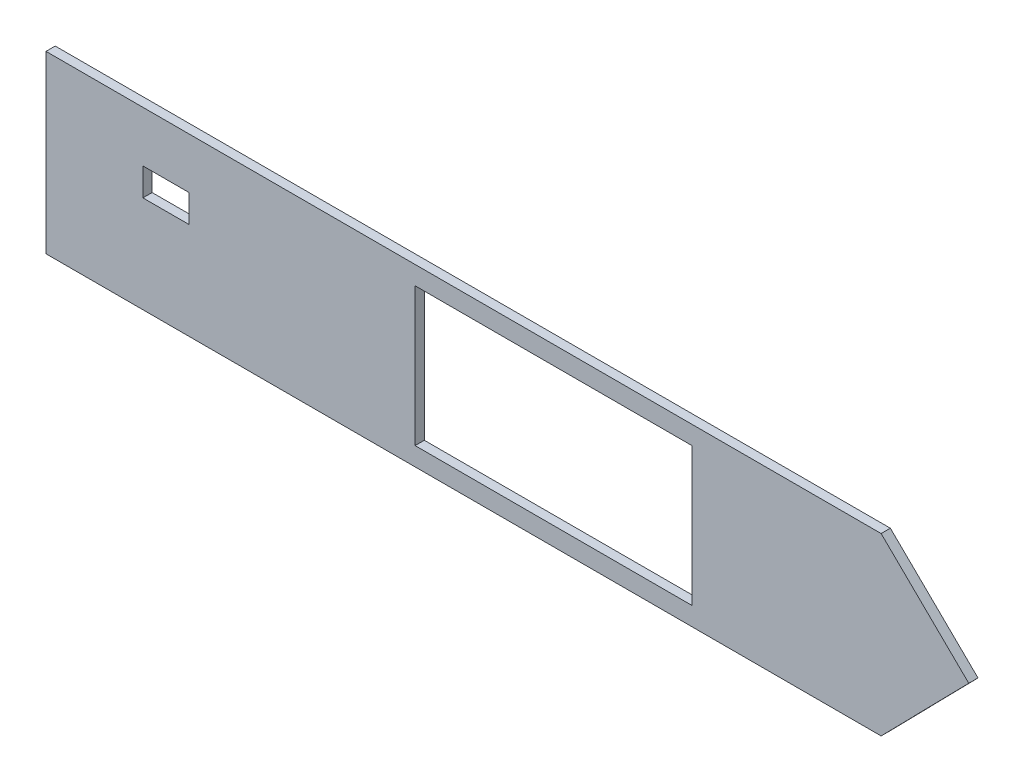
from build123d import *

# Parameters (mm, degrees)
F_2_POSTES_W       = 30
F_2_POSTES_H       = 15
F_2_POSTES_W_2     = 5
F_2_POSTES_H_2     = 3
BOSS_EXTRU_1_DEPTH = 1
F_2_POSTES_3_W     = 30
F_2_POSTES_3_H     = 15
F_2_POSTES_3_W_2   = 5
F_2_POSTES_3_H_2   = 3
BOSS_EXTRU_2_DEPTH = 1


with BuildPart() as part:
    # 2 postes → Boss.-Extru.1 (new body)
    with BuildSketch(Plane.XY):
        Polygon((-40, 17), (50.502014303, 17), (60, 7.695621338), (50.502014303, -2), (-40, -2), align=None)
        with Locations((15, 7.5)):
            Rectangle(F_2_POSTES_W, F_2_POSTES_H, mode=Mode.SUBTRACT)
        with Locations((-27, 10)):
            Rectangle(F_2_POSTES_W_2, F_2_POSTES_H_2, mode=Mode.SUBTRACT)
    extrude(amount=BOSS_EXTRU_1_DEPTH)

    # 2 postes_3 → Boss.-Extru.2 (add)
    with BuildSketch(Plane.XY):
        Polygon((-40, 17), (50.502014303, 17), (60, 7.695621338), (50.502014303, -2), (-40, -2), align=None)
        with Locations((15, 7.5)):
            Rectangle(F_2_POSTES_3_W, F_2_POSTES_3_H, mode=Mode.SUBTRACT)
        with Locations((-27, 10)):
            Rectangle(F_2_POSTES_3_W_2, F_2_POSTES_3_H_2, mode=Mode.SUBTRACT)
    extrude(amount=BOSS_EXTRU_2_DEPTH)


solid = part.part
